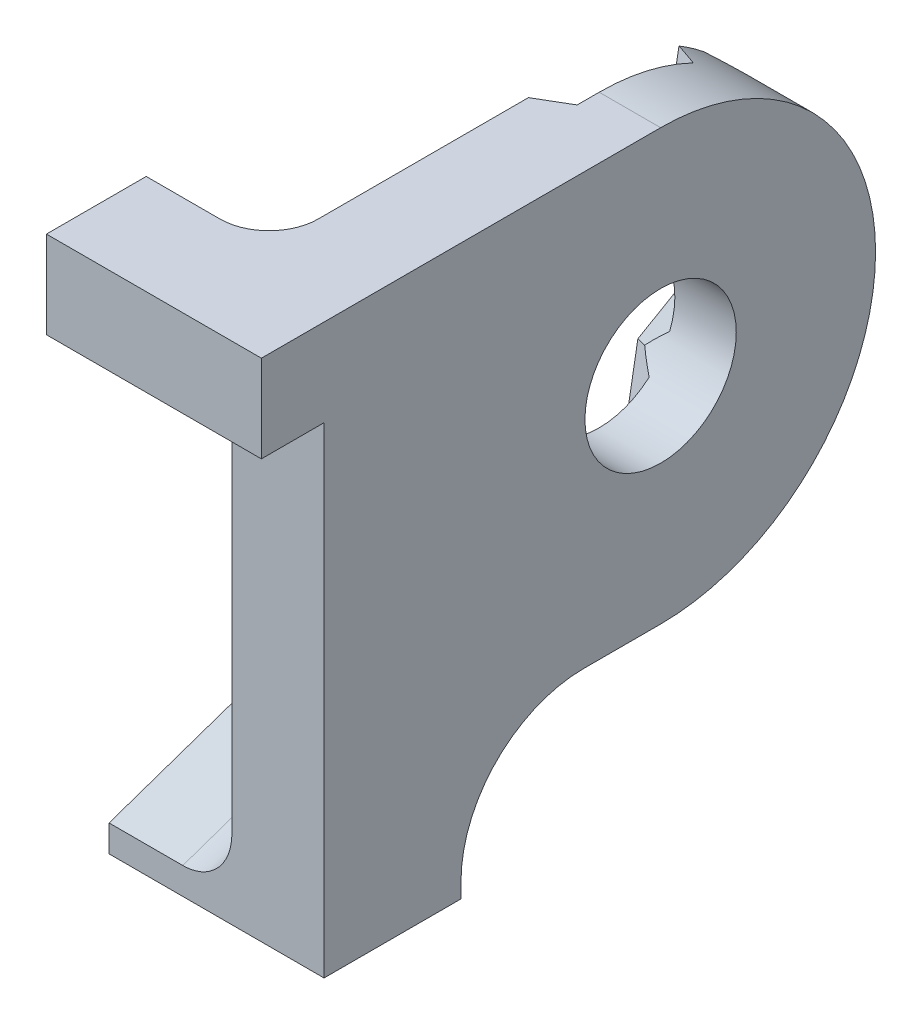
ISO-10303-21;
HEADER;
FILE_DESCRIPTION(('STEP AP214'),'2;1');
FILE_NAME('part.step','',(''),(''),'','','');
FILE_SCHEMA(('AUTOMOTIVE_DESIGN { 1 0 10303 214 1 1 1 1 }'));
ENDSEC;
DATA;
#1=APPLICATION_CONTEXT('core data for automotive mechanical design processes');
#2=APPLICATION_PROTOCOL_DEFINITION('international standard','automotive_design',2000,#1);
#3=PRODUCT_CONTEXT('',#1,'mechanical');
#4=PRODUCT('Part','Part','',(#3));
#5=PRODUCT_RELATED_PRODUCT_CATEGORY('part','',(#4));
#6=PRODUCT_DEFINITION_FORMATION('','',#4);
#7=PRODUCT_DEFINITION_CONTEXT('part definition',#1,'design');
#8=PRODUCT_DEFINITION('design','',#6,#7);
#9=PRODUCT_DEFINITION_SHAPE('','',#8);
#10=(LENGTH_UNIT() NAMED_UNIT(*) SI_UNIT(.MILLI.,.METRE.));
#11=(NAMED_UNIT(*) PLANE_ANGLE_UNIT() SI_UNIT($,.RADIAN.));
#12=(NAMED_UNIT(*) SI_UNIT($,.STERADIAN.) SOLID_ANGLE_UNIT());
#13=UNCERTAINTY_MEASURE_WITH_UNIT(LENGTH_MEASURE(1.E-05),#10,'distance_accuracy_value','');
#14=(GEOMETRIC_REPRESENTATION_CONTEXT(3) GLOBAL_UNCERTAINTY_ASSIGNED_CONTEXT((#13)) GLOBAL_UNIT_ASSIGNED_CONTEXT((#10,
#11,#12)) REPRESENTATION_CONTEXT('',''));
#15=CARTESIAN_POINT('',(0.,0.,0.));
#16=DIRECTION('',(0.,0.,1.));
#17=DIRECTION('',(1.,0.,0.));
#18=AXIS2_PLACEMENT_3D('',#15,#16,#17);
#19=CARTESIAN_POINT('',(1.5875,0.,0.));
#20=DIRECTION('',(-1.,0.,0.));
#21=DIRECTION('',(0.,0.,1.));
#22=AXIS2_PLACEMENT_3D('',#19,#20,#21);
#23=PLANE('',#22);
#24=CARTESIAN_POINT('',(1.5875,0.,0.));
#25=DIRECTION('',(-1.,0.,0.));
#26=DIRECTION('',(0.,0.,1.));
#27=AXIS2_PLACEMENT_3D('',#24,#25,#26);
#28=CIRCLE('',#27,11.1125);
#29=CARTESIAN_POINT('',(1.5875,11.1125,0.));
#30=VERTEX_POINT('',#29);
#31=CARTESIAN_POINT('',(1.5875,9.99277444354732,-4.86128739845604));
#32=VERTEX_POINT('',#31);
#33=EDGE_CURVE('E287',#30,#32,#28,.T.);
#34=ORIENTED_EDGE('',*,*,#33,.T.);
#35=DIRECTION('',(0.,-0.984807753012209,0.173648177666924));
#36=VECTOR('',#35,1.);
#37=CARTESIAN_POINT('',(1.5875,-0.530010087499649,-3.00583657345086));
#38=LINE('',#37,#36);
#39=CARTESIAN_POINT('',(1.5875,5.91602724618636,-4.14244687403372));
#40=VERTEX_POINT('',#39);
#41=EDGE_CURVE('E422',#32,#40,#38,.T.);
#42=ORIENTED_EDGE('',*,*,#41,.T.);
#43=DIRECTION('',(0.,0.499999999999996,-0.866025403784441));
#44=VECTOR('',#43,1.);
#45=CARTESIAN_POINT('',(1.5875,7.83310237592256,-7.46291840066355));
#46=LINE('',#45,#44);
#47=CARTESIAN_POINT('',(1.5875,7.98584604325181,-7.72747819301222));
#48=VERTEX_POINT('',#47);
#49=EDGE_CURVE('E420',#40,#48,#46,.T.);
#50=ORIENTED_EDGE('',*,*,#49,.T.);
#51=CARTESIAN_POINT('',(1.5875,2.69926940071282,-10.7796846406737));
#52=VERTEX_POINT('',#51);
#53=EDGE_CURVE('E286',#48,#52,#28,.T.);
#54=ORIENTED_EDGE('',*,*,#53,.T.);
#55=DIRECTION('',(0.,-0.499999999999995,0.866025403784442));
#56=VECTOR('',#55,1.);
#57=CARTESIAN_POINT('',(1.5875,-1.71795906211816,-3.12882051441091));
#58=LINE('',#57,#56);
#59=CARTESIAN_POINT('',(1.5875,-1.4201110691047,-3.64470837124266));
#60=VERTEX_POINT('',#59);
#61=EDGE_CURVE('E411',#52,#60,#58,.T.);
#62=ORIENTED_EDGE('',*,*,#61,.T.);
#63=CARTESIAN_POINT('',(1.5875,0.,0.));
#64=DIRECTION('',(-1.,0.,0.));
#65=DIRECTION('',(0.,0.,1.));
#66=AXIS2_PLACEMENT_3D('',#63,#64,#65);
#67=CIRCLE('',#66,3.9116);
#68=CARTESIAN_POINT('',(1.5875,2.93919896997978,2.58103157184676));
#69=VERTEX_POINT('',#68);
#70=EDGE_CURVE('E281',#69,#60,#67,.T.);
#71=ORIENTED_EDGE('',*,*,#70,.F.);
#72=DIRECTION('',(0.,0.984807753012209,-0.173648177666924));
#73=VECTOR('',#72,1.);
#74=CARTESIAN_POINT('',(1.5875,10.953343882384,1.16792159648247));
#75=LINE('',#74,#73);
#76=CARTESIAN_POINT('',(1.5875,11.1125,1.13985807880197));
#77=VERTEX_POINT('',#76);
#78=EDGE_CURVE('E418',#69,#77,#75,.T.);
#79=ORIENTED_EDGE('',*,*,#78,.T.);
#80=DIRECTION('',(0.,0.,-1.));
#81=VECTOR('',#80,1.);
#82=CARTESIAN_POINT('',(1.5875,11.1125,2.07054079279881));
#83=LINE('',#82,#81);
#84=EDGE_CURVE('E407',#77,#30,#83,.T.);
#85=ORIENTED_EDGE('',*,*,#84,.T.);
#86=EDGE_LOOP('',(#34,#42,#50,#54,#62,#71,#79,#85));
#87=FACE_BOUND('',#86,.T.);
#88=ADVANCED_FACE('F37',(#87),#23,.T.);
#89=CARTESIAN_POINT('',(0.,0.,0.));
#90=DIRECTION('',(-1.,0.,0.));
#91=DIRECTION('',(0.,0.,1.));
#92=AXIS2_PLACEMENT_3D('',#89,#90,#91);
#93=PLANE('',#92);
#94=DIRECTION('',(0.,-0.499999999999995,0.866025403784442));
#95=VECTOR('',#94,1.);
#96=CARTESIAN_POINT('',(0.,2.51170906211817,3.58709229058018));
#97=LINE('',#96,#95);
#98=CARTESIAN_POINT('',(0.,2.51170906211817,3.58709229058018));
#99=VERTEX_POINT('',#98);
#100=CARTESIAN_POINT('',(0.,-2.51608667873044,12.2954899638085));
#101=VERTEX_POINT('',#100);
#102=EDGE_CURVE('E240',#99,#101,#97,.T.);
#103=ORIENTED_EDGE('',*,*,#102,.T.);
#104=CARTESIAN_POINT('',(0.,-2.51608667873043,12.2954899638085));
#105=CARTESIAN_POINT('',(0.,-2.57222081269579,12.3927224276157));
#106=CARTESIAN_POINT('',(0.,-2.62954856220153,12.4892603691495));
#107=CARTESIAN_POINT('',(0.,-2.74654023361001,12.6809067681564));
#108=CARTESIAN_POINT('',(0.,-2.8062040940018,12.7760152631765));
#109=CARTESIAN_POINT('',(0.,-2.98857847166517,13.0590670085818));
#110=CARTESIAN_POINT('',(0.,-3.1147173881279,13.2448154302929));
#111=CARTESIAN_POINT('',(0.,-3.37467790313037,13.6091491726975));
#112=CARTESIAN_POINT('',(0.,-3.5084487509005,13.787770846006));
#113=CARTESIAN_POINT('',(0.,-3.78356531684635,14.13908811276));
#114=CARTESIAN_POINT('',(0.,-3.9249114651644,14.3117833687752));
#115=CARTESIAN_POINT('',(0.,-4.21403023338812,14.6511401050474));
#116=CARTESIAN_POINT('',(0.,-4.36179047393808,14.8178121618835));
#117=CARTESIAN_POINT('',(0.,-4.66313169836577,15.1458189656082));
#118=CARTESIAN_POINT('',(0.,-4.81671312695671,15.307153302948));
#119=CARTESIAN_POINT('',(0.,-5.12984263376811,15.6258826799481));
#120=CARTESIAN_POINT('',(0.,-5.28942184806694,15.7832470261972));
#121=CARTESIAN_POINT('',(0.,-5.61286757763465,16.0934035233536));
#122=CARTESIAN_POINT('',(0.,-5.7767326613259,16.2461971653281));
#123=CARTESIAN_POINT('',(0.,-5.942407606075,16.3969647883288));
#124=B_SPLINE_CURVE_WITH_KNOTS('',3,(#104,#105,#106,#107,#108,#109,#110,#111,#112,#113,#114,
#115,#116,#117,#118,#119,#120,#121,#122,#123),.UNSPECIFIED.,.F.,.F.,(4,2,2,2,2,2,2,2,2,4),(0.,
0.336800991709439,0.673593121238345,1.34690425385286,2.01616719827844,2.6854681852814,
3.35353032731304,4.02164360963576,4.6939068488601,5.36594833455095),.UNSPECIFIED.);
#125=CARTESIAN_POINT('',(0.,-5.942407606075,16.3969647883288));
#126=VERTEX_POINT('',#125);
#127=EDGE_CURVE('E435',#101,#126,#124,.T.);
#128=ORIENTED_EDGE('',*,*,#127,.T.);
#129=DIRECTION('',(0.,-0.866025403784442,-0.499999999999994));
#130=VECTOR('',#129,1.);
#131=CARTESIAN_POINT('',(0.,-0.386157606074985,19.6048672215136));
#132=LINE('',#131,#130);
#133=CARTESIAN_POINT('',(0.,-11.228984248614,13.3447583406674));
#134=VERTEX_POINT('',#133);
#135=EDGE_CURVE('E246',#126,#134,#132,.T.);
#136=ORIENTED_EDGE('',*,*,#135,.T.);
#137=CARTESIAN_POINT('',(0.,-11.228984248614,13.3447583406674));
#138=CARTESIAN_POINT('',(0.,-11.1812531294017,13.1258958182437));
#139=CARTESIAN_POINT('',(0.,-11.1308624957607,12.9075876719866));
#140=CARTESIAN_POINT('',(0.,-11.0239819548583,12.4723972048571));
#141=CARTESIAN_POINT('',(0.,-10.9674900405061,12.2555153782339));
#142=CARTESIAN_POINT('',(0.,-10.8480270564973,11.8249725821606));
#143=CARTESIAN_POINT('',(0.,-10.7850981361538,11.6112999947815));
#144=CARTESIAN_POINT('',(0.,-10.6517065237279,11.1863274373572));
#145=CARTESIAN_POINT('',(0.,-10.5812444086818,10.9750272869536));
#146=CARTESIAN_POINT('',(0.,-10.4319122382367,10.5549647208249));
#147=CARTESIAN_POINT('',(0.,-10.3530268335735,10.3462077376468));
#148=CARTESIAN_POINT('',(0.,-10.1863354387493,9.93229116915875));
#149=CARTESIAN_POINT('',(0.,-10.0985299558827,9.72713138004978));
#150=CARTESIAN_POINT('',(0.,-9.91298793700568,9.31983209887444));
#151=CARTESIAN_POINT('',(0.,-9.81519454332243,9.11771838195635));
#152=CARTESIAN_POINT('',(0.,-9.66125173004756,8.81825166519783));
#153=CARTESIAN_POINT('',(0.,-9.60871728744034,8.71902699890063));
#154=CARTESIAN_POINT('',(0.,-9.50124247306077,8.52188603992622));
#155=CARTESIAN_POINT('',(0.,-9.44630203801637,8.42396978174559));
#156=CARTESIAN_POINT('',(0.,-9.39016332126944,8.32673996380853));
#157=B_SPLINE_CURVE_WITH_KNOTS('',3,(#137,#138,#139,#140,#141,#142,#143,#144,#145,#146,#147,
#148,#149,#150,#151,#152,#153,#154,#155,#156),.UNSPECIFIED.,.F.,.F.,(4,2,2,2,2,2,2,2,2,4),(0.,
0.67204148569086,1.3443047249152,2.01241800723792,2.68048014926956,3.34978113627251,
4.0190440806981,4.69235521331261,5.02914734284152,5.36594833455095),.UNSPECIFIED.);
#158=CARTESIAN_POINT('',(0.,-9.39016332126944,8.32673996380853));
#159=VERTEX_POINT('',#158);
#160=EDGE_CURVE('E46',#134,#159,#157,.T.);
#161=ORIENTED_EDGE('',*,*,#160,.T.);
#162=DIRECTION('',(0.,0.499999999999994,-0.866025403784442));
#163=VECTOR('',#162,1.);
#164=CARTESIAN_POINT('',(0.,-9.39016332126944,8.32673996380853));
#165=LINE('',#164,#163);
#166=CARTESIAN_POINT('',(0.,-7.69254424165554,5.38637746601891));
#167=VERTEX_POINT('',#166);
#168=EDGE_CURVE('E260',#159,#167,#165,.T.);
#169=ORIENTED_EDGE('',*,*,#168,.T.);
#170=DIRECTION('',(0.,-0.984807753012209,0.173648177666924));
#171=VECTOR('',#170,1.);
#172=CARTESIAN_POINT('',(0.,-7.69254424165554,5.38637746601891));
#173=LINE('',#172,#171);
#174=CARTESIAN_POINT('',(0.,-11.4637228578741,6.05133800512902));
#175=VERTEX_POINT('',#174);
#176=EDGE_CURVE('E262',#167,#175,#173,.T.);
#177=ORIENTED_EDGE('',*,*,#176,.T.);
#178=CARTESIAN_POINT('',(0.,-17.4625,3.96875));
#179=DIRECTION('',(-1.,0.,0.));
#180=DIRECTION('',(0.,0.,1.));
#181=AXIS2_PLACEMENT_3D('',#178,#179,#180);
#182=CIRCLE('',#181,6.35);
#183=CARTESIAN_POINT('',(0.,-17.4625,10.31875));
#184=VERTEX_POINT('',#183);
#185=EDGE_CURVE('E336',#184,#175,#182,.T.);
#186=ORIENTED_EDGE('',*,*,#185,.F.);
#187=DIRECTION('',(0.,-1.,0.));
#188=VECTOR('',#187,1.);
#189=CARTESIAN_POINT('',(0.,0.,10.31875));
#190=LINE('',#189,#188);
#191=CARTESIAN_POINT('',(0.,-11.7464179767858,10.31875));
#192=VERTEX_POINT('',#191);
#193=EDGE_CURVE('E304',#192,#184,#190,.T.);
#194=ORIENTED_EDGE('',*,*,#193,.F.);
#195=DIRECTION('',(0.,0.325568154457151,-0.945518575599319));
#196=VECTOR('',#195,1.);
#197=CARTESIAN_POINT('',(0.,-14.4690829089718,18.2259431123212));
#198=LINE('',#197,#196);
#199=CARTESIAN_POINT('',(0.,-14.1843435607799,17.399));
#200=VERTEX_POINT('',#199);
#201=EDGE_CURVE('E389',#192,#200,#198,.F.);
#202=ORIENTED_EDGE('',*,*,#201,.T.);
#203=DIRECTION('',(0.,-1.,0.));
#204=VECTOR('',#203,1.);
#205=CARTESIAN_POINT('',(0.,6.604,17.399));
#206=LINE('',#205,#204);
#207=CARTESIAN_POINT('',(0.,6.604,17.399));
#208=VERTEX_POINT('',#207);
#209=EDGE_CURVE('E357',#208,#200,#206,.T.);
#210=ORIENTED_EDGE('',*,*,#209,.F.);
#211=DIRECTION('',(0.,0.,1.));
#212=VECTOR('',#211,1.);
#213=CARTESIAN_POINT('',(0.,6.604,0.));
#214=LINE('',#213,#212);
#215=CARTESIAN_POINT('',(0.,6.604,12.938125));
#216=VERTEX_POINT('',#215);
#217=EDGE_CURVE('E324',#216,#208,#214,.T.);
#218=ORIENTED_EDGE('',*,*,#217,.F.);
#219=DIRECTION('',(0.,-1.,0.));
#220=VECTOR('',#219,1.);
#221=CARTESIAN_POINT('',(0.,11.1125,12.938125));
#222=LINE('',#221,#220);
#223=CARTESIAN_POINT('',(0.,11.1125,12.938125));
#224=VERTEX_POINT('',#223);
#225=EDGE_CURVE('E387',#216,#224,#222,.F.);
#226=ORIENTED_EDGE('',*,*,#225,.T.);
#227=DIRECTION('',(0.,0.,1.));
#228=VECTOR('',#227,1.);
#229=CARTESIAN_POINT('',(0.,11.1125,0.));
#230=LINE('',#229,#228);
#231=CARTESIAN_POINT('',(0.,11.1125,2.07054079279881));
#232=VERTEX_POINT('',#231);
#233=EDGE_CURVE('E243',#232,#224,#230,.T.);
#234=ORIENTED_EDGE('',*,*,#233,.F.);
#235=DIRECTION('',(0.,-0.984807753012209,0.173648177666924));
#236=VECTOR('',#235,1.);
#237=CARTESIAN_POINT('',(0.,11.1125,2.07054079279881));
#238=LINE('',#237,#236);
#239=EDGE_CURVE('E236',#232,#99,#238,.T.);
#240=ORIENTED_EDGE('',*,*,#239,.T.);
#241=EDGE_LOOP('',(#103,#128,#136,#161,#169,#177,#186,#194,#202,#210,#218,#226,#234,#240));
#242=FACE_BOUND('',#241,.T.);
#243=ADVANCED_FACE('F238',(#242),#93,.T.);
#244=CARTESIAN_POINT('',(0.,0.,0.));
#245=DIRECTION('',(1.,0.,0.));
#246=DIRECTION('',(0.,0.,1.));
#247=AXIS2_PLACEMENT_3D('',#244,#245,#246);
#248=CIRCLE('',#247,11.1125);
#249=CARTESIAN_POINT('',(0.,8.62685237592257,-7.00464662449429));
#250=VERTEX_POINT('',#249);
#251=CARTESIAN_POINT('',(0.,9.53277203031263,-5.71085927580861));
#252=VERTEX_POINT('',#251);
#253=EDGE_CURVE('E331',#250,#252,#248,.T.);
#254=ORIENTED_EDGE('',*,*,#253,.F.);
#255=DIRECTION('',(0.,-0.499999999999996,0.866025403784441));
#256=VECTOR('',#255,1.);
#257=CARTESIAN_POINT('',(0.,8.99328832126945,-7.63933229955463));
#258=LINE('',#257,#256);
#259=CARTESIAN_POINT('',(0.,7.69254424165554,-5.3863774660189));
#260=VERTEX_POINT('',#259);
#261=EDGE_CURVE('E272',#250,#260,#258,.T.);
#262=ORIENTED_EDGE('',*,*,#261,.T.);
#263=DIRECTION('',(0.,-0.984807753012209,0.173648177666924));
#264=VECTOR('',#263,1.);
#265=CARTESIAN_POINT('',(0.,11.1125,-5.98940793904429));
#266=LINE('',#265,#264);
#267=EDGE_CURVE('E274',#252,#260,#266,.T.);
#268=ORIENTED_EDGE('',*,*,#267,.F.);
#269=EDGE_LOOP('',(#254,#262,#268));
#270=FACE_BOUND('',#269,.T.);
#271=ADVANCED_FACE('F455',(#270),#93,.T.);
#272=CARTESIAN_POINT('',(4.7625,0.,0.));
#273=DIRECTION('',(-1.,0.,0.));
#274=DIRECTION('',(0.,0.,1.));
#275=AXIS2_PLACEMENT_3D('',#272,#273,#274);
#276=CYLINDRICAL_SURFACE('',#275,11.1125);
#277=ORIENTED_EDGE('',*,*,#253,.T.);
#278=CARTESIAN_POINT('',(6.87407664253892,0.,0.));
#279=DIRECTION('',(0.500000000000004,-0.150383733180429,-0.852868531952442));
#280=DIRECTION('',(-0.866025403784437,-0.0868240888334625,-0.492403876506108));
#281=AXIS2_PLACEMENT_3D('',#278,#279,#280);
#282=ELLIPSE('',#281,22.2249999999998,11.1125);
#283=EDGE_CURVE('E431',#252,#32,#282,.T.);
#284=ORIENTED_EDGE('',*,*,#283,.T.);
#285=ORIENTED_EDGE('',*,*,#33,.F.);
#286=DIRECTION('',(-1.,0.,0.));
#287=VECTOR('',#286,1.);
#288=CARTESIAN_POINT('',(4.7625,11.1125,0.));
#289=LINE('',#288,#287);
#290=CARTESIAN_POINT('',(4.7625,11.1125,0.));
#291=VERTEX_POINT('',#290);
#292=EDGE_CURVE('E381',#291,#30,#289,.T.);
#293=ORIENTED_EDGE('',*,*,#292,.F.);
#294=CARTESIAN_POINT('',(4.7625,0.,0.));
#295=DIRECTION('',(1.,0.,0.));
#296=DIRECTION('',(0.,0.,1.));
#297=AXIS2_PLACEMENT_3D('',#294,#295,#296);
#298=CIRCLE('',#297,11.1125);
#299=CARTESIAN_POINT('',(4.7625,-11.1125,0.));
#300=VERTEX_POINT('',#299);
#301=EDGE_CURVE('E332',#300,#291,#298,.T.);
#302=ORIENTED_EDGE('',*,*,#301,.F.);
#303=DIRECTION('',(-1.,0.,0.));
#304=VECTOR('',#303,1.);
#305=CARTESIAN_POINT('',(4.7625,-11.1125,0.));
#306=LINE('',#305,#304);
#307=CARTESIAN_POINT('',(1.5875,-11.1125,0.));
#308=VERTEX_POINT('',#307);
#309=EDGE_CURVE('E352',#300,#308,#306,.T.);
#310=ORIENTED_EDGE('',*,*,#309,.T.);
#311=CARTESIAN_POINT('',(1.5875,-11.0527946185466,-1.15038574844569));
#312=VERTEX_POINT('',#311);
#313=EDGE_CURVE('E284',#312,#308,#28,.T.);
#314=ORIENTED_EDGE('',*,*,#313,.F.);
#315=CARTESIAN_POINT('',(6.87407664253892,0.,0.));
#316=DIRECTION('',(0.500000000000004,-0.150383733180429,-0.852868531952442));
#317=DIRECTION('',(-0.866025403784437,-0.0868240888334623,-0.492403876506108));
#318=AXIS2_PLACEMENT_3D('',#315,#316,#317);
#319=ELLIPSE('',#318,22.2249999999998,11.1125);
#320=CARTESIAN_POINT('',(0.,-10.9111044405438,-2.10605226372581));
#321=VERTEX_POINT('',#320);
#322=EDGE_CURVE('E627',#312,#321,#319,.T.);
#323=ORIENTED_EDGE('',*,*,#322,.T.);
#324=CARTESIAN_POINT('',(0.,1.75277573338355,-10.9733966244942));
#325=VERTEX_POINT('',#324);
#326=EDGE_CURVE('E355',#321,#325,#248,.T.);
#327=ORIENTED_EDGE('',*,*,#326,.T.);
#328=CARTESIAN_POINT('',(6.87407664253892,0.,0.));
#329=DIRECTION('',(-0.500000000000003,0.750000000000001,0.433012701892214));
#330=DIRECTION('',(-0.866025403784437,-0.433012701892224,-0.249999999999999));
#331=AXIS2_PLACEMENT_3D('',#328,#329,#330);
#332=ELLIPSE('',#331,22.2249999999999,11.1125);
#333=EDGE_CURVE('E623',#325,#52,#332,.F.);
#334=ORIENTED_EDGE('',*,*,#333,.T.);
#335=ORIENTED_EDGE('',*,*,#53,.F.);
#336=CARTESIAN_POINT('',(6.8740766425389,0.,0.));
#337=DIRECTION('',(-0.500000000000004,-0.75,-0.433012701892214));
#338=DIRECTION('',(-0.866025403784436,0.433012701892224,0.25));
#339=AXIS2_PLACEMENT_3D('',#336,#337,#338);
#340=ELLIPSE('',#339,22.2249999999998,11.1125);
#341=EDGE_CURVE('E433',#48,#250,#340,.F.);
#342=ORIENTED_EDGE('',*,*,#341,.T.);
#343=EDGE_LOOP('',(#277,#284,#285,#293,#302,#310,#314,#323,#327,#334,#335,#342));
#344=FACE_BOUND('',#343,.T.);
#345=ADVANCED_FACE('F597',(#344),#276,.T.);
#346=CARTESIAN_POINT('',(4.7625,11.1125,0.));
#347=DIRECTION('',(0.,-1.,0.));
#348=DIRECTION('',(0.,0.,-1.));
#349=AXIS2_PLACEMENT_3D('',#346,#347,#348);
#350=PLANE('',#349);
#351=ORIENTED_EDGE('',*,*,#84,.F.);
#352=DIRECTION('',(0.862679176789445,0.,-0.505751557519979));
#353=VECTOR('',#352,1.);
#354=CARTESIAN_POINT('',(4.44770537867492,11.1125,-0.536956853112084));
#355=LINE('',#354,#353);
#356=EDGE_CURVE('E631',#77,#232,#355,.F.);
#357=ORIENTED_EDGE('',*,*,#356,.T.);
#358=ORIENTED_EDGE('',*,*,#233,.T.);
#359=CARTESIAN_POINT('',(-2.54,11.1125,12.938125));
#360=DIRECTION('',(0.,-1.,0.));
#361=DIRECTION('',(0.,0.,-1.));
#362=AXIS2_PLACEMENT_3D('',#359,#360,#361);
#363=CIRCLE('',#362,2.54);
#364=CARTESIAN_POINT('',(-2.54,11.1125,15.478125));
#365=VERTEX_POINT('',#364);
#366=EDGE_CURVE('E402',#224,#365,#363,.T.);
#367=ORIENTED_EDGE('',*,*,#366,.T.);
#368=DIRECTION('',(1.,0.,0.));
#369=VECTOR('',#368,1.);
#370=CARTESIAN_POINT('',(-6.35,11.1125,15.478125));
#371=LINE('',#370,#369);
#372=CARTESIAN_POINT('',(-6.35,11.1125,15.478125));
#373=VERTEX_POINT('',#372);
#374=EDGE_CURVE('E321',#373,#365,#371,.T.);
#375=ORIENTED_EDGE('',*,*,#374,.F.);
#376=DIRECTION('',(0.,0.,1.));
#377=VECTOR('',#376,1.);
#378=CARTESIAN_POINT('',(-6.35,11.1125,20.6375));
#379=LINE('',#378,#377);
#380=CARTESIAN_POINT('',(-6.35,11.1125,20.6375));
#381=VERTEX_POINT('',#380);
#382=EDGE_CURVE('E317',#373,#381,#379,.T.);
#383=ORIENTED_EDGE('',*,*,#382,.T.);
#384=DIRECTION('',(-1.,0.,0.));
#385=VECTOR('',#384,1.);
#386=CARTESIAN_POINT('',(4.7625,11.1125,20.6375));
#387=LINE('',#386,#385);
#388=CARTESIAN_POINT('',(4.7625,11.1125,20.6375));
#389=VERTEX_POINT('',#388);
#390=EDGE_CURVE('E379',#389,#381,#387,.T.);
#391=ORIENTED_EDGE('',*,*,#390,.F.);
#392=DIRECTION('',(0.,0.,1.));
#393=VECTOR('',#392,1.);
#394=CARTESIAN_POINT('',(4.7625,11.1125,0.));
#395=LINE('',#394,#393);
#396=EDGE_CURVE('E335',#291,#389,#395,.T.);
#397=ORIENTED_EDGE('',*,*,#396,.F.);
#398=ORIENTED_EDGE('',*,*,#292,.T.);
#399=EDGE_LOOP('',(#351,#357,#358,#367,#375,#383,#391,#397,#398));
#400=FACE_BOUND('',#399,.T.);
#401=ADVANCED_FACE('F576',(#400),#350,.F.);
#402=CARTESIAN_POINT('',(4.7625,-11.1125,0.));
#403=DIRECTION('',(0.,1.,0.));
#404=DIRECTION('',(0.,0.,1.));
#405=AXIS2_PLACEMENT_3D('',#402,#403,#404);
#406=PLANE('',#405);
#407=DIRECTION('',(0.,0.,1.));
#408=VECTOR('',#407,1.);
#409=CARTESIAN_POINT('',(1.5875,-11.1125,0.));
#410=LINE('',#409,#408);
#411=CARTESIAN_POINT('',(1.5875,-11.1125,3.96874999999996));
#412=VERTEX_POINT('',#411);
#413=EDGE_CURVE('E278',#308,#412,#410,.T.);
#414=ORIENTED_EDGE('',*,*,#413,.F.);
#415=ORIENTED_EDGE('',*,*,#309,.F.);
#416=DIRECTION('',(0.,0.,-1.));
#417=VECTOR('',#416,1.);
#418=CARTESIAN_POINT('',(4.7625,-11.1125,0.));
#419=LINE('',#418,#417);
#420=CARTESIAN_POINT('',(4.7625,-11.1125,3.96874999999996));
#421=VERTEX_POINT('',#420);
#422=EDGE_CURVE('E350',#421,#300,#419,.T.);
#423=ORIENTED_EDGE('',*,*,#422,.F.);
#424=DIRECTION('',(-1.,0.,0.));
#425=VECTOR('',#424,1.);
#426=CARTESIAN_POINT('',(4.7625,-11.1125,3.96874999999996));
#427=LINE('',#426,#425);
#428=EDGE_CURVE('E364',#421,#412,#427,.T.);
#429=ORIENTED_EDGE('',*,*,#428,.T.);
#430=EDGE_LOOP('',(#414,#415,#423,#429));
#431=FACE_BOUND('',#430,.T.);
#432=ADVANCED_FACE('F457',(#431),#406,.F.);
#433=CARTESIAN_POINT('',(4.7625,0.,0.));
#434=DIRECTION('',(-1.,0.,0.));
#435=DIRECTION('',(0.,0.,1.));
#436=AXIS2_PLACEMENT_3D('',#433,#434,#435);
#437=CYLINDRICAL_SURFACE('',#436,3.9116);
#438=CARTESIAN_POINT('',(4.7625,0.,0.));
#439=DIRECTION('',(1.,0.,0.));
#440=DIRECTION('',(0.,0.,-1.));
#441=AXIS2_PLACEMENT_3D('',#438,#439,#440);
#442=CIRCLE('',#441,3.9116);
#443=CARTESIAN_POINT('',(4.7625,0.,-3.9116));
#444=VERTEX_POINT('',#443);
#445=EDGE_CURVE('E328',#444,#444,#442,.T.);
#446=ORIENTED_EDGE('',*,*,#445,.T.);
#447=EDGE_LOOP('',(#446));
#448=FACE_BOUND('',#447,.T.);
#449=CARTESIAN_POINT('',(1.5875,-2.93919896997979,-2.58103157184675));
#450=VERTEX_POINT('',#449);
#451=CARTESIAN_POINT('',(1.5875,1.42011106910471,3.64470837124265));
#452=VERTEX_POINT('',#451);
#453=EDGE_CURVE('E405',#450,#452,#67,.T.);
#454=ORIENTED_EDGE('',*,*,#453,.T.);
#455=CARTESIAN_POINT('',(6.87407664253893,0.,0.));
#456=DIRECTION('',(-0.500000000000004,-0.750000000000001,-0.433012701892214));
#457=DIRECTION('',(-0.866025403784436,0.433012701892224,0.249999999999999));
#458=AXIS2_PLACEMENT_3D('',#455,#456,#457);
#459=ELLIPSE('',#458,7.82319999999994,3.9116);
#460=CARTESIAN_POINT('',(0.733759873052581,2.24360158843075,3.20419513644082));
#461=VERTEX_POINT('',#460);
#462=EDGE_CURVE('E61',#452,#461,#459,.T.);
#463=ORIENTED_EDGE('',*,*,#462,.T.);
#464=CARTESIAN_POINT('',(6.87407664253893,0.,0.));
#465=DIRECTION('',(-0.500000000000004,-0.150383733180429,-0.852868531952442));
#466=DIRECTION('',(-0.866025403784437,0.0868240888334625,0.492403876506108));
#467=AXIS2_PLACEMENT_3D('',#464,#465,#466);
#468=ELLIPSE('',#467,7.82319999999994,3.9116);
#469=EDGE_CURVE('E252',#461,#69,#468,.T.);
#470=ORIENTED_EDGE('',*,*,#469,.T.);
#471=ORIENTED_EDGE('',*,*,#70,.T.);
#472=CARTESIAN_POINT('',(6.87407664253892,0.,0.));
#473=DIRECTION('',(-0.500000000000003,0.750000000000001,0.433012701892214));
#474=DIRECTION('',(-0.866025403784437,-0.433012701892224,-0.249999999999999));
#475=AXIS2_PLACEMENT_3D('',#472,#473,#474);
#476=ELLIPSE('',#475,7.82319999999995,3.9116);
#477=CARTESIAN_POINT('',(0.733759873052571,-2.24360158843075,-3.20419513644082));
#478=VERTEX_POINT('',#477);
#479=EDGE_CURVE('E54',#60,#478,#476,.T.);
#480=ORIENTED_EDGE('',*,*,#479,.T.);
#481=CARTESIAN_POINT('',(6.87407664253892,0.,0.));
#482=DIRECTION('',(0.500000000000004,-0.150383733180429,-0.852868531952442));
#483=DIRECTION('',(-0.866025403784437,-0.0868240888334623,-0.492403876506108));
#484=AXIS2_PLACEMENT_3D('',#481,#482,#483);
#485=ELLIPSE('',#484,7.82319999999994,3.9116);
#486=EDGE_CURVE('E625',#478,#450,#485,.F.);
#487=ORIENTED_EDGE('',*,*,#486,.T.);
#488=EDGE_LOOP('',(#454,#463,#470,#471,#480,#487));
#489=FACE_BOUND('',#488,.T.);
#490=ADVANCED_FACE('F632',(#448,#489),#437,.F.);
#491=CARTESIAN_POINT('',(4.7625,0.,0.));
#492=DIRECTION('',(-1.,0.,0.));
#493=DIRECTION('',(0.,0.,1.));
#494=AXIS2_PLACEMENT_3D('',#491,#492,#493);
#495=PLANE('',#494);
#496=DIRECTION('',(0.,-1.,0.));
#497=VECTOR('',#496,1.);
#498=CARTESIAN_POINT('',(4.7625,6.604,17.399));
#499=LINE('',#498,#497);
#500=CARTESIAN_POINT('',(4.7625,6.604,17.399));
#501=VERTEX_POINT('',#500);
#502=CARTESIAN_POINT('',(4.7625,-18.25625,17.399));
#503=VERTEX_POINT('',#502);
#504=EDGE_CURVE('E342',#501,#503,#499,.T.);
#505=ORIENTED_EDGE('',*,*,#504,.T.);
#506=DIRECTION('',(0.,0.,-1.));
#507=VECTOR('',#506,1.);
#508=CARTESIAN_POINT('',(4.7625,-18.25625,17.399));
#509=LINE('',#508,#507);
#510=CARTESIAN_POINT('',(4.7625,-18.25625,10.31875));
#511=VERTEX_POINT('',#510);
#512=EDGE_CURVE('E344',#503,#511,#509,.T.);
#513=ORIENTED_EDGE('',*,*,#512,.T.);
#514=DIRECTION('',(0.,1.,0.));
#515=VECTOR('',#514,1.);
#516=CARTESIAN_POINT('',(4.7625,-18.25625,10.31875));
#517=LINE('',#516,#515);
#518=CARTESIAN_POINT('',(4.7625,-17.4625,10.31875));
#519=VERTEX_POINT('',#518);
#520=EDGE_CURVE('E346',#511,#519,#517,.T.);
#521=ORIENTED_EDGE('',*,*,#520,.T.);
#522=CARTESIAN_POINT('',(4.7625,-17.4625,3.96875));
#523=DIRECTION('',(-1.,0.,0.));
#524=DIRECTION('',(0.,0.,1.));
#525=AXIS2_PLACEMENT_3D('',#522,#523,#524);
#526=CIRCLE('',#525,6.35);
#527=EDGE_CURVE('E348',#519,#421,#526,.T.);
#528=ORIENTED_EDGE('',*,*,#527,.T.);
#529=ORIENTED_EDGE('',*,*,#422,.T.);
#530=ORIENTED_EDGE('',*,*,#301,.T.);
#531=ORIENTED_EDGE('',*,*,#396,.T.);
#532=DIRECTION('',(0.,-1.,0.));
#533=VECTOR('',#532,1.);
#534=CARTESIAN_POINT('',(4.7625,11.1125,20.6375));
#535=LINE('',#534,#533);
#536=CARTESIAN_POINT('',(4.7625,6.604,20.6375));
#537=VERTEX_POINT('',#536);
#538=EDGE_CURVE('E338',#389,#537,#535,.T.);
#539=ORIENTED_EDGE('',*,*,#538,.T.);
#540=DIRECTION('',(0.,0.,-1.));
#541=VECTOR('',#540,1.);
#542=CARTESIAN_POINT('',(4.7625,6.604,20.6375));
#543=LINE('',#542,#541);
#544=EDGE_CURVE('E340',#537,#501,#543,.T.);
#545=ORIENTED_EDGE('',*,*,#544,.T.);
#546=EDGE_LOOP('',(#505,#513,#521,#528,#529,#530,#531,#539,#545));
#547=FACE_BOUND('',#546,.T.);
#548=ORIENTED_EDGE('',*,*,#445,.F.);
#549=EDGE_LOOP('',(#548));
#550=FACE_BOUND('',#549,.T.);
#551=ADVANCED_FACE('F453',(#547,#550),#495,.F.);
#552=DIRECTION('',(0.,-0.984807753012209,0.173648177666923));
#553=VECTOR('',#552,1.);
#554=CARTESIAN_POINT('',(0.,-2.51170906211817,-3.58709229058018));
#555=LINE('',#554,#553);
#556=CARTESIAN_POINT('',(0.,-2.51170906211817,-3.58709229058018));
#557=VERTEX_POINT('',#556);
#558=EDGE_CURVE('E267',#557,#321,#555,.T.);
#559=ORIENTED_EDGE('',*,*,#558,.F.);
#560=DIRECTION('',(0.,0.499999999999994,-0.866025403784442));
#561=VECTOR('',#560,1.);
#562=CARTESIAN_POINT('',(0.,-2.51170906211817,-3.58709229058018));
#563=LINE('',#562,#561);
#564=EDGE_CURVE('E270',#557,#325,#563,.T.);
#565=ORIENTED_EDGE('',*,*,#564,.T.);
#566=ORIENTED_EDGE('',*,*,#326,.F.);
#567=EDGE_LOOP('',(#559,#565,#566));
#568=FACE_BOUND('',#567,.T.);
#569=ADVANCED_FACE('F447',(#568),#93,.T.);
#570=CARTESIAN_POINT('',(4.7625,11.1125,20.6375));
#571=DIRECTION('',(0.,0.,-1.));
#572=DIRECTION('',(-1.,0.,0.));
#573=AXIS2_PLACEMENT_3D('',#570,#571,#572);
#574=PLANE('',#573);
#575=ORIENTED_EDGE('',*,*,#390,.T.);
#576=DIRECTION('',(0.,-1.,0.));
#577=VECTOR('',#576,1.);
#578=CARTESIAN_POINT('',(-6.35,11.1125,20.6375));
#579=LINE('',#578,#577);
#580=CARTESIAN_POINT('',(-6.35,6.604,20.6375));
#581=VERTEX_POINT('',#580);
#582=EDGE_CURVE('E308',#381,#581,#579,.T.);
#583=ORIENTED_EDGE('',*,*,#582,.T.);
#584=DIRECTION('',(-1.,0.,0.));
#585=VECTOR('',#584,1.);
#586=CARTESIAN_POINT('',(4.7625,6.604,20.6375));
#587=LINE('',#586,#585);
#588=EDGE_CURVE('E377',#537,#581,#587,.T.);
#589=ORIENTED_EDGE('',*,*,#588,.F.);
#590=ORIENTED_EDGE('',*,*,#538,.F.);
#591=EDGE_LOOP('',(#575,#583,#589,#590));
#592=FACE_BOUND('',#591,.T.);
#593=ADVANCED_FACE('F452',(#592),#574,.F.);
#594=CARTESIAN_POINT('',(4.7625,6.604,20.6375));
#595=DIRECTION('',(0.,1.,0.));
#596=DIRECTION('',(0.,0.,1.));
#597=AXIS2_PLACEMENT_3D('',#594,#595,#596);
#598=PLANE('',#597);
#599=ORIENTED_EDGE('',*,*,#588,.T.);
#600=DIRECTION('',(0.,0.,-1.));
#601=VECTOR('',#600,1.);
#602=CARTESIAN_POINT('',(-6.35,6.604,20.6375));
#603=LINE('',#602,#601);
#604=CARTESIAN_POINT('',(-6.35,6.604,15.478125));
#605=VERTEX_POINT('',#604);
#606=EDGE_CURVE('E311',#581,#605,#603,.T.);
#607=ORIENTED_EDGE('',*,*,#606,.T.);
#608=DIRECTION('',(1.,0.,0.));
#609=VECTOR('',#608,1.);
#610=CARTESIAN_POINT('',(-6.35,6.604,15.478125));
#611=LINE('',#610,#609);
#612=CARTESIAN_POINT('',(-2.54,6.604,15.478125));
#613=VERTEX_POINT('',#612);
#614=EDGE_CURVE('E320',#605,#613,#611,.T.);
#615=ORIENTED_EDGE('',*,*,#614,.T.);
#616=CARTESIAN_POINT('',(-2.54,6.604,12.938125));
#617=DIRECTION('',(0.,1.,0.));
#618=DIRECTION('',(0.,0.,1.));
#619=AXIS2_PLACEMENT_3D('',#616,#617,#618);
#620=CIRCLE('',#619,2.54);
#621=EDGE_CURVE('E399',#613,#216,#620,.T.);
#622=ORIENTED_EDGE('',*,*,#621,.T.);
#623=ORIENTED_EDGE('',*,*,#217,.T.);
#624=DIRECTION('',(-1.,0.,0.));
#625=VECTOR('',#624,1.);
#626=CARTESIAN_POINT('',(4.7625,6.604,17.399));
#627=LINE('',#626,#625);
#628=EDGE_CURVE('E374',#501,#208,#627,.T.);
#629=ORIENTED_EDGE('',*,*,#628,.F.);
#630=ORIENTED_EDGE('',*,*,#544,.F.);
#631=EDGE_LOOP('',(#599,#607,#615,#622,#623,#629,#630));
#632=FACE_BOUND('',#631,.T.);
#633=ADVANCED_FACE('F570',(#632),#598,.F.);
#634=CARTESIAN_POINT('',(4.7625,6.604,17.399));
#635=DIRECTION('',(0.,0.,-1.));
#636=DIRECTION('',(0.,1.,0.));
#637=AXIS2_PLACEMENT_3D('',#634,#635,#636);
#638=PLANE('',#637);
#639=ORIENTED_EDGE('',*,*,#209,.T.);
#640=CARTESIAN_POINT('',(-2.54,-14.1843435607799,17.399));
#641=DIRECTION('',(0.,0.,-1.));
#642=DIRECTION('',(0.,-1.,0.));
#643=AXIS2_PLACEMENT_3D('',#640,#641,#642);
#644=ELLIPSE('',#643,2.68635653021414,2.54);
#645=CARTESIAN_POINT('',(-2.54,-16.870700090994,17.399));
#646=VERTEX_POINT('',#645);
#647=EDGE_CURVE('E397',#200,#646,#644,.T.);
#648=ORIENTED_EDGE('',*,*,#647,.T.);
#649=DIRECTION('',(1.,0.,0.));
#650=VECTOR('',#649,1.);
#651=CARTESIAN_POINT('',(-6.35,-16.870700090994,17.399));
#652=LINE('',#651,#650);
#653=CARTESIAN_POINT('',(-6.35,-16.870700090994,17.399));
#654=VERTEX_POINT('',#653);
#655=EDGE_CURVE('E301',#654,#646,#652,.T.);
#656=ORIENTED_EDGE('',*,*,#655,.F.);
#657=DIRECTION('',(0.,-1.,0.));
#658=VECTOR('',#657,1.);
#659=CARTESIAN_POINT('',(-6.35,-16.870700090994,17.399));
#660=LINE('',#659,#658);
#661=CARTESIAN_POINT('',(-6.35,-18.25625,17.399));
#662=VERTEX_POINT('',#661);
#663=EDGE_CURVE('E288',#654,#662,#660,.T.);
#664=ORIENTED_EDGE('',*,*,#663,.T.);
#665=DIRECTION('',(-1.,0.,0.));
#666=VECTOR('',#665,1.);
#667=CARTESIAN_POINT('',(4.7625,-18.25625,17.399));
#668=LINE('',#667,#666);
#669=EDGE_CURVE('E372',#503,#662,#668,.T.);
#670=ORIENTED_EDGE('',*,*,#669,.F.);
#671=ORIENTED_EDGE('',*,*,#504,.F.);
#672=ORIENTED_EDGE('',*,*,#628,.T.);
#673=EDGE_LOOP('',(#639,#648,#656,#664,#670,#671,#672));
#674=FACE_BOUND('',#673,.T.);
#675=ADVANCED_FACE('F547',(#674),#638,.F.);
#676=CARTESIAN_POINT('',(4.7625,-18.25625,17.399));
#677=DIRECTION('',(0.,1.,0.));
#678=DIRECTION('',(0.,0.,1.));
#679=AXIS2_PLACEMENT_3D('',#676,#677,#678);
#680=PLANE('',#679);
#681=ORIENTED_EDGE('',*,*,#669,.T.);
#682=DIRECTION('',(0.,0.,-1.));
#683=VECTOR('',#682,1.);
#684=CARTESIAN_POINT('',(-6.35,-18.25625,17.399));
#685=LINE('',#684,#683);
#686=CARTESIAN_POINT('',(-6.35,-18.25625,10.31875));
#687=VERTEX_POINT('',#686);
#688=EDGE_CURVE('E291',#662,#687,#685,.T.);
#689=ORIENTED_EDGE('',*,*,#688,.T.);
#690=DIRECTION('',(-1.,0.,0.));
#691=VECTOR('',#690,1.);
#692=CARTESIAN_POINT('',(4.7625,-18.25625,10.31875));
#693=LINE('',#692,#691);
#694=EDGE_CURVE('E370',#511,#687,#693,.T.);
#695=ORIENTED_EDGE('',*,*,#694,.F.);
#696=ORIENTED_EDGE('',*,*,#512,.F.);
#697=EDGE_LOOP('',(#681,#689,#695,#696));
#698=FACE_BOUND('',#697,.T.);
#699=ADVANCED_FACE('F563',(#698),#680,.F.);
#700=CARTESIAN_POINT('',(4.7625,-18.25625,10.31875));
#701=DIRECTION('',(0.,0.,1.));
#702=DIRECTION('',(1.,0.,0.));
#703=AXIS2_PLACEMENT_3D('',#700,#701,#702);
#704=PLANE('',#703);
#705=ORIENTED_EDGE('',*,*,#694,.T.);
#706=DIRECTION('',(0.,1.,0.));
#707=VECTOR('',#706,1.);
#708=CARTESIAN_POINT('',(-6.35,-18.25625,10.31875));
#709=LINE('',#708,#707);
#710=CARTESIAN_POINT('',(-6.35,-14.4327745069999,10.31875));
#711=VERTEX_POINT('',#710);
#712=EDGE_CURVE('E294',#687,#711,#709,.T.);
#713=ORIENTED_EDGE('',*,*,#712,.T.);
#714=DIRECTION('',(1.,0.,0.));
#715=VECTOR('',#714,1.);
#716=CARTESIAN_POINT('',(-6.35,-14.4327745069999,10.31875));
#717=LINE('',#716,#715);
#718=CARTESIAN_POINT('',(-2.54,-14.4327745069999,10.31875));
#719=VERTEX_POINT('',#718);
#720=EDGE_CURVE('E300',#711,#719,#717,.T.);
#721=ORIENTED_EDGE('',*,*,#720,.T.);
#722=CARTESIAN_POINT('',(-2.54,-11.7464179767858,10.31875));
#723=DIRECTION('',(0.,0.,1.));
#724=DIRECTION('',(0.,-1.,0.));
#725=AXIS2_PLACEMENT_3D('',#722,#723,#724);
#726=ELLIPSE('',#725,2.68635653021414,2.54);
#727=EDGE_CURVE('E394',#719,#192,#726,.T.);
#728=ORIENTED_EDGE('',*,*,#727,.T.);
#729=ORIENTED_EDGE('',*,*,#193,.T.);
#730=DIRECTION('',(-1.,0.,0.));
#731=VECTOR('',#730,1.);
#732=CARTESIAN_POINT('',(4.7625,-17.4625,10.31875));
#733=LINE('',#732,#731);
#734=EDGE_CURVE('E367',#519,#184,#733,.T.);
#735=ORIENTED_EDGE('',*,*,#734,.F.);
#736=ORIENTED_EDGE('',*,*,#520,.F.);
#737=EDGE_LOOP('',(#705,#713,#721,#728,#729,#735,#736));
#738=FACE_BOUND('',#737,.T.);
#739=ADVANCED_FACE('F541',(#738),#704,.F.);
#740=CARTESIAN_POINT('',(4.7625,-17.4625,3.96875));
#741=DIRECTION('',(-1.,0.,0.));
#742=DIRECTION('',(0.,0.,1.));
#743=AXIS2_PLACEMENT_3D('',#740,#741,#742);
#744=CYLINDRICAL_SURFACE('',#743,6.35);
#745=ORIENTED_EDGE('',*,*,#185,.T.);
#746=CARTESIAN_POINT('',(5.35658455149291,-17.4625,3.96875));
#747=DIRECTION('',(-0.500000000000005,-0.150383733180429,-0.852868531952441));
#748=DIRECTION('',(-0.866025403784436,0.086824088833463,0.49240387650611));
#749=AXIS2_PLACEMENT_3D('',#746,#747,#748);
#750=ELLIPSE('',#749,12.6999999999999,6.35);
#751=CARTESIAN_POINT('',(1.5875,-11.2097585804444,5.07587453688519));
#752=VERTEX_POINT('',#751);
#753=EDGE_CURVE('E11',#175,#752,#750,.T.);
#754=ORIENTED_EDGE('',*,*,#753,.T.);
#755=CARTESIAN_POINT('',(1.5875,-17.4625,3.96875));
#756=DIRECTION('',(-1.,0.,0.));
#757=DIRECTION('',(0.,0.,1.));
#758=AXIS2_PLACEMENT_3D('',#755,#756,#757);
#759=CIRCLE('',#758,6.35);
#760=EDGE_CURVE('E280',#412,#752,#759,.F.);
#761=ORIENTED_EDGE('',*,*,#760,.F.);
#762=ORIENTED_EDGE('',*,*,#428,.F.);
#763=ORIENTED_EDGE('',*,*,#527,.F.);
#764=ORIENTED_EDGE('',*,*,#734,.T.);
#765=EDGE_LOOP('',(#745,#754,#761,#762,#763,#764));
#766=FACE_BOUND('',#765,.T.);
#767=ADVANCED_FACE('F534',(#766),#744,.F.);
#768=CARTESIAN_POINT('',(-6.35,11.1125,15.478125));
#769=DIRECTION('',(0.,0.,-1.));
#770=DIRECTION('',(0.,1.,0.));
#771=AXIS2_PLACEMENT_3D('',#768,#769,#770);
#772=PLANE('',#771);
#773=ORIENTED_EDGE('',*,*,#374,.T.);
#774=DIRECTION('',(0.,-1.,0.));
#775=VECTOR('',#774,1.);
#776=CARTESIAN_POINT('',(-2.54,6.604,15.478125));
#777=LINE('',#776,#775);
#778=EDGE_CURVE('E391',#365,#613,#777,.T.);
#779=ORIENTED_EDGE('',*,*,#778,.T.);
#780=ORIENTED_EDGE('',*,*,#614,.F.);
#781=DIRECTION('',(0.,1.,0.));
#782=VECTOR('',#781,1.);
#783=CARTESIAN_POINT('',(-6.35,11.1125,15.478125));
#784=LINE('',#783,#782);
#785=EDGE_CURVE('E314',#605,#373,#784,.T.);
#786=ORIENTED_EDGE('',*,*,#785,.T.);
#787=EDGE_LOOP('',(#773,#779,#780,#786));
#788=FACE_BOUND('',#787,.T.);
#789=ADVANCED_FACE('F578',(#788),#772,.T.);
#790=CARTESIAN_POINT('',(-6.35,0.,0.));
#791=DIRECTION('',(1.,0.,0.));
#792=DIRECTION('',(0.,0.,-1.));
#793=AXIS2_PLACEMENT_3D('',#790,#791,#792);
#794=PLANE('',#793);
#795=ORIENTED_EDGE('',*,*,#582,.F.);
#796=ORIENTED_EDGE('',*,*,#382,.F.);
#797=ORIENTED_EDGE('',*,*,#785,.F.);
#798=ORIENTED_EDGE('',*,*,#606,.F.);
#799=EDGE_LOOP('',(#795,#796,#797,#798));
#800=FACE_BOUND('',#799,.T.);
#801=ADVANCED_FACE('F584',(#800),#794,.F.);
#802=CARTESIAN_POINT('',(-6.35,-14.4327745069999,10.31875));
#803=DIRECTION('',(0.,0.945518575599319,0.325568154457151));
#804=DIRECTION('',(0.,-0.325568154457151,0.945518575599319));
#805=AXIS2_PLACEMENT_3D('',#802,#803,#804);
#806=PLANE('',#805);
#807=ORIENTED_EDGE('',*,*,#655,.T.);
#808=DIRECTION('',(0.,0.325568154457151,-0.945518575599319));
#809=VECTOR('',#808,1.);
#810=CARTESIAN_POINT('',(-2.54,-14.4327745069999,10.31875));
#811=LINE('',#810,#809);
#812=EDGE_CURVE('E384',#646,#719,#811,.T.);
#813=ORIENTED_EDGE('',*,*,#812,.T.);
#814=ORIENTED_EDGE('',*,*,#720,.F.);
#815=DIRECTION('',(0.,-0.325568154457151,0.945518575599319));
#816=VECTOR('',#815,1.);
#817=CARTESIAN_POINT('',(-6.35,-14.4327745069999,10.31875));
#818=LINE('',#817,#816);
#819=EDGE_CURVE('E297',#711,#654,#818,.T.);
#820=ORIENTED_EDGE('',*,*,#819,.T.);
#821=EDGE_LOOP('',(#807,#813,#814,#820));
#822=FACE_BOUND('',#821,.T.);
#823=ADVANCED_FACE('F552',(#822),#806,.T.);
#824=CARTESIAN_POINT('',(-6.35,0.,0.));
#825=DIRECTION('',(1.,0.,0.));
#826=DIRECTION('',(0.,0.,-1.));
#827=AXIS2_PLACEMENT_3D('',#824,#825,#826);
#828=PLANE('',#827);
#829=ORIENTED_EDGE('',*,*,#663,.F.);
#830=ORIENTED_EDGE('',*,*,#819,.F.);
#831=ORIENTED_EDGE('',*,*,#712,.F.);
#832=ORIENTED_EDGE('',*,*,#688,.F.);
#833=EDGE_LOOP('',(#829,#830,#831,#832));
#834=FACE_BOUND('',#833,.T.);
#835=ADVANCED_FACE('F559',(#834),#828,.F.);
#836=CARTESIAN_POINT('',(-2.54,-12.0311573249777,11.1456931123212));
#837=DIRECTION('',(0.,-0.325568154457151,0.945518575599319));
#838=DIRECTION('',(0.,-0.945518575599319,-0.325568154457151));
#839=AXIS2_PLACEMENT_3D('',#836,#837,#838);
#840=CYLINDRICAL_SURFACE('',#839,2.54);
#841=ORIENTED_EDGE('',*,*,#647,.F.);
#842=ORIENTED_EDGE('',*,*,#201,.F.);
#843=ORIENTED_EDGE('',*,*,#727,.F.);
#844=ORIENTED_EDGE('',*,*,#812,.F.);
#845=EDGE_LOOP('',(#841,#842,#843,#844));
#846=FACE_BOUND('',#845,.T.);
#847=ADVANCED_FACE('F504',(#846),#840,.F.);
#848=CARTESIAN_POINT('',(-2.54,11.1125,12.938125));
#849=DIRECTION('',(0.,1.,0.));
#850=DIRECTION('',(0.,0.,1.));
#851=AXIS2_PLACEMENT_3D('',#848,#849,#850);
#852=CYLINDRICAL_SURFACE('',#851,2.54);
#853=ORIENTED_EDGE('',*,*,#366,.F.);
#854=ORIENTED_EDGE('',*,*,#225,.F.);
#855=ORIENTED_EDGE('',*,*,#621,.F.);
#856=ORIENTED_EDGE('',*,*,#778,.F.);
#857=EDGE_LOOP('',(#853,#854,#855,#856));
#858=FACE_BOUND('',#857,.T.);
#859=ADVANCED_FACE('F496',(#858),#852,.F.);
#860=DIRECTION('',(0.,-0.866025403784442,-0.499999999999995));
#861=VECTOR('',#860,1.);
#862=CARTESIAN_POINT('',(1.5875,-2.51608667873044,12.2954899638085));
#863=LINE('',#862,#861);
#864=CARTESIAN_POINT('',(1.5875,-3.30983667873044,11.8372181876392));
#865=VERTEX_POINT('',#864);
#866=CARTESIAN_POINT('',(1.5875,-8.59641332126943,8.7850117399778));
#867=VERTEX_POINT('',#866);
#868=EDGE_CURVE('E277',#865,#867,#863,.T.);
#869=ORIENTED_EDGE('',*,*,#868,.F.);
#870=DIRECTION('',(0.,0.499999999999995,-0.866025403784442));
#871=VECTOR('',#870,1.);
#872=CARTESIAN_POINT('',(1.5875,1.71795906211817,3.12882051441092));
#873=LINE('',#872,#871);
#874=EDGE_CURVE('E416',#865,#452,#873,.T.);
#875=ORIENTED_EDGE('',*,*,#874,.T.);
#876=ORIENTED_EDGE('',*,*,#453,.F.);
#877=DIRECTION('',(0.,-0.984807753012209,0.173648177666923));
#878=VECTOR('',#877,1.);
#879=CARTESIAN_POINT('',(1.5875,-0.530010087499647,-3.00583657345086));
#880=LINE('',#879,#878);
#881=EDGE_CURVE('E413',#450,#312,#880,.T.);
#882=ORIENTED_EDGE('',*,*,#881,.T.);
#883=ORIENTED_EDGE('',*,*,#313,.T.);
#884=ORIENTED_EDGE('',*,*,#413,.T.);
#885=ORIENTED_EDGE('',*,*,#760,.T.);
#886=DIRECTION('',(0.,0.984807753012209,-0.173648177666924));
#887=VECTOR('',#886,1.);
#888=CARTESIAN_POINT('',(1.5875,-7.8517003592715,4.48375826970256));
#889=LINE('',#888,#887);
#890=CARTESIAN_POINT('',(1.5875,-5.91602724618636,4.14244687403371));
#891=VERTEX_POINT('',#890);
#892=EDGE_CURVE('E409',#752,#891,#889,.T.);
#893=ORIENTED_EDGE('',*,*,#892,.T.);
#894=DIRECTION('',(0.,-0.499999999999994,0.866025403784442));
#895=VECTOR('',#894,1.);
#896=CARTESIAN_POINT('',(1.5875,-8.59641332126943,8.7850117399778));
#897=LINE('',#896,#895);
#898=EDGE_CURVE('E404',#891,#867,#897,.T.);
#899=ORIENTED_EDGE('',*,*,#898,.T.);
#900=EDGE_LOOP('',(#869,#875,#876,#882,#883,#884,#885,#893,#899));
#901=FACE_BOUND('',#900,.T.);
#902=ADVANCED_FACE('F487',(#901),#23,.T.);
#903=CARTESIAN_POINT('',(-7.9375,2.24641332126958,15.045120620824));
#904=DIRECTION('',(0.,-0.866025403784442,-0.499999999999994));
#905=DIRECTION('',(0.,0.499999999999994,-0.866025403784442));
#906=AXIS2_PLACEMENT_3D('',#903,#904,#905);
#907=CYLINDRICAL_SURFACE('',#906,9.525);
#908=ORIENTED_EDGE('',*,*,#135,.F.);
#909=CARTESIAN_POINT('',(-7.9375,-3.30983667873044,11.8372181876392));
#910=DIRECTION('',(0.,-0.866025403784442,-0.499999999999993));
#911=DIRECTION('',(0.,0.499999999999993,-0.866025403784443));
#912=AXIS2_PLACEMENT_3D('',#909,#910,#911);
#913=CIRCLE('',#912,9.525);
#914=EDGE_CURVE('E428',#126,#865,#913,.F.);
#915=ORIENTED_EDGE('',*,*,#914,.T.);
#916=ORIENTED_EDGE('',*,*,#868,.T.);
#917=CARTESIAN_POINT('',(-7.9375,-8.59641332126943,8.7850117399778));
#918=DIRECTION('',(0.,0.866025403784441,0.499999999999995));
#919=DIRECTION('',(0.,-0.499999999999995,0.866025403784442));
#920=AXIS2_PLACEMENT_3D('',#917,#918,#919);
#921=CIRCLE('',#920,9.525);
#922=EDGE_CURVE('E425',#867,#134,#921,.F.);
#923=ORIENTED_EDGE('',*,*,#922,.T.);
#924=EDGE_LOOP('',(#908,#915,#916,#923));
#925=FACE_BOUND('',#924,.T.);
#926=ADVANCED_FACE('F495',(#925),#907,.F.);
#927=CARTESIAN_POINT('',(0.,8.99328832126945,-7.63933229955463));
#928=DIRECTION('',(-0.500000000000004,-0.75,-0.433012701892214));
#929=DIRECTION('',(0.,0.499999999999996,-0.866025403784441));
#930=AXIS2_PLACEMENT_3D('',#927,#928,#929);
#931=PLANE('',#930);
#932=ORIENTED_EDGE('',*,*,#341,.F.);
#933=ORIENTED_EDGE('',*,*,#49,.F.);
#934=DIRECTION('',(0.590661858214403,-0.660989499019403,0.462829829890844));
#935=VECTOR('',#934,1.);
#936=CARTESIAN_POINT('',(-1.12374179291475,8.95008527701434,-6.26691717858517));
#937=LINE('',#936,#935);
#938=EDGE_CURVE('E254',#260,#40,#937,.T.);
#939=ORIENTED_EDGE('',*,*,#938,.F.);
#940=ORIENTED_EDGE('',*,*,#261,.F.);
#941=EDGE_LOOP('',(#932,#933,#939,#940));
#942=FACE_BOUND('',#941,.T.);
#943=ADVANCED_FACE('F502',(#942),#931,.T.);
#944=CARTESIAN_POINT('',(1.5875,-0.530010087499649,-3.00583657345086));
#945=DIRECTION('',(0.500000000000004,-0.150383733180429,-0.852868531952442));
#946=DIRECTION('',(0.,-0.984807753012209,0.173648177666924));
#947=AXIS2_PLACEMENT_3D('',#944,#945,#946);
#948=PLANE('',#947);
#949=ORIENTED_EDGE('',*,*,#283,.F.);
#950=ORIENTED_EDGE('',*,*,#267,.T.);
#951=ORIENTED_EDGE('',*,*,#938,.T.);
#952=ORIENTED_EDGE('',*,*,#41,.F.);
#953=EDGE_LOOP('',(#949,#950,#951,#952));
#954=FACE_BOUND('',#953,.T.);
#955=ADVANCED_FACE('F603',(#954),#948,.F.);
#956=CARTESIAN_POINT('',(0.,11.1125,2.07054079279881));
#957=DIRECTION('',(-0.500000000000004,-0.150383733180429,-0.852868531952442));
#958=DIRECTION('',(0.,0.984807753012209,-0.173648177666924));
#959=AXIS2_PLACEMENT_3D('',#956,#957,#958);
#960=PLANE('',#959);
#961=ORIENTED_EDGE('',*,*,#78,.F.);
#962=ORIENTED_EDGE('',*,*,#469,.F.);
#963=DIRECTION('',(-0.843404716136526,0.308170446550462,0.44011300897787));
#964=VECTOR('',#963,1.);
#965=CARTESIAN_POINT('',(-1.67251839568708,3.12282817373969,4.45986083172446));
#966=LINE('',#965,#964);
#967=EDGE_CURVE('E249',#99,#461,#966,.F.);
#968=ORIENTED_EDGE('',*,*,#967,.F.);
#969=ORIENTED_EDGE('',*,*,#239,.F.);
#970=ORIENTED_EDGE('',*,*,#356,.F.);
#971=EDGE_LOOP('',(#961,#962,#968,#969,#970));
#972=FACE_BOUND('',#971,.T.);
#973=ADVANCED_FACE('F251',(#972),#960,.T.);
#974=CARTESIAN_POINT('',(0.,2.51170906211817,3.58709229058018));
#975=DIRECTION('',(-0.500000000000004,-0.750000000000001,-0.433012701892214));
#976=DIRECTION('',(0.,0.499999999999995,-0.866025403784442));
#977=AXIS2_PLACEMENT_3D('',#974,#975,#976);
#978=PLANE('',#977);
#979=ORIENTED_EDGE('',*,*,#462,.F.);
#980=ORIENTED_EDGE('',*,*,#874,.F.);
#981=DIRECTION('',(0.866025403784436,-0.433012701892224,-0.25));
#982=VECTOR('',#981,1.);
#983=CARTESIAN_POINT('',(0.,-2.51608667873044,12.2954899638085));
#984=LINE('',#983,#982);
#985=EDGE_CURVE('E255',#101,#865,#984,.T.);
#986=ORIENTED_EDGE('',*,*,#985,.F.);
#987=ORIENTED_EDGE('',*,*,#102,.F.);
#988=ORIENTED_EDGE('',*,*,#967,.T.);
#989=EDGE_LOOP('',(#979,#980,#986,#987,#988));
#990=FACE_BOUND('',#989,.T.);
#991=ADVANCED_FACE('F257',(#990),#978,.T.);
#992=CARTESIAN_POINT('',(-7.9375,-2.51608667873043,12.2954899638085));
#993=DIRECTION('',(0.,-0.866025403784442,-0.499999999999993));
#994=DIRECTION('',(0.,0.499999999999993,-0.866025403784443));
#995=AXIS2_PLACEMENT_3D('',#992,#993,#994);
#996=CONICAL_SURFACE('',#995,7.93750000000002,1.04719755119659);
#997=ORIENTED_EDGE('',*,*,#985,.T.);
#998=ORIENTED_EDGE('',*,*,#914,.F.);
#999=ORIENTED_EDGE('',*,*,#127,.F.);
#1000=EDGE_LOOP('',(#997,#998,#999));
#1001=FACE_BOUND('',#1000,.T.);
#1002=ADVANCED_FACE('F443',(#1001),#996,.F.);
#1003=CARTESIAN_POINT('',(0.,-2.51170906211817,-3.58709229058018));
#1004=DIRECTION('',(-0.500000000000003,0.750000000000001,0.433012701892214));
#1005=DIRECTION('',(0.,-0.499999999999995,0.866025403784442));
#1006=AXIS2_PLACEMENT_3D('',#1003,#1004,#1005);
#1007=PLANE('',#1006);
#1008=ORIENTED_EDGE('',*,*,#333,.F.);
#1009=ORIENTED_EDGE('',*,*,#564,.F.);
#1010=DIRECTION('',(0.843404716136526,0.308170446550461,0.44011300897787));
#1011=VECTOR('',#1010,1.);
#1012=CARTESIAN_POINT('',(1.8600652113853,-1.83206248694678,-2.61645638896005));
#1013=LINE('',#1012,#1011);
#1014=EDGE_CURVE('E521',#478,#557,#1013,.F.);
#1015=ORIENTED_EDGE('',*,*,#1014,.F.);
#1016=ORIENTED_EDGE('',*,*,#479,.F.);
#1017=ORIENTED_EDGE('',*,*,#61,.F.);
#1018=EDGE_LOOP('',(#1008,#1009,#1015,#1016,#1017));
#1019=FACE_BOUND('',#1018,.T.);
#1020=ADVANCED_FACE('F474',(#1019),#1007,.T.);
#1021=CARTESIAN_POINT('',(1.5875,-0.530010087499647,-3.00583657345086));
#1022=DIRECTION('',(0.500000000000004,-0.150383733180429,-0.852868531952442));
#1023=DIRECTION('',(0.,-0.984807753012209,0.173648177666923));
#1024=AXIS2_PLACEMENT_3D('',#1021,#1022,#1023);
#1025=PLANE('',#1024);
#1026=ORIENTED_EDGE('',*,*,#1014,.T.);
#1027=ORIENTED_EDGE('',*,*,#558,.T.);
#1028=ORIENTED_EDGE('',*,*,#322,.F.);
#1029=ORIENTED_EDGE('',*,*,#881,.F.);
#1030=ORIENTED_EDGE('',*,*,#486,.F.);
#1031=EDGE_LOOP('',(#1026,#1027,#1028,#1029,#1030));
#1032=FACE_BOUND('',#1031,.T.);
#1033=ADVANCED_FACE('F481',(#1032),#1025,.F.);
#1034=CARTESIAN_POINT('',(0.,-7.69254424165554,5.38637746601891));
#1035=DIRECTION('',(-0.500000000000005,-0.150383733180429,-0.852868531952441));
#1036=DIRECTION('',(0.,0.984807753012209,-0.173648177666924));
#1037=AXIS2_PLACEMENT_3D('',#1034,#1035,#1036);
#1038=PLANE('',#1037);
#1039=ORIENTED_EDGE('',*,*,#753,.F.);
#1040=ORIENTED_EDGE('',*,*,#176,.F.);
#1041=DIRECTION('',(-0.590661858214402,-0.660989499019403,0.462829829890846));
#1042=VECTOR('',#1041,1.);
#1043=CARTESIAN_POINT('',(-1.46661094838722,-9.33377843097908,6.53558201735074));
#1044=LINE('',#1043,#1042);
#1045=EDGE_CURVE('E41',#891,#167,#1044,.T.);
#1046=ORIENTED_EDGE('',*,*,#1045,.F.);
#1047=ORIENTED_EDGE('',*,*,#892,.F.);
#1048=EDGE_LOOP('',(#1039,#1040,#1046,#1047));
#1049=FACE_BOUND('',#1048,.T.);
#1050=ADVANCED_FACE('F39',(#1049),#1038,.T.);
#1051=CARTESIAN_POINT('',(0.,-9.39016332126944,8.32673996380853));
#1052=DIRECTION('',(-0.500000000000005,0.75,0.433012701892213));
#1053=DIRECTION('',(0.,-0.499999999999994,0.866025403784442));
#1054=AXIS2_PLACEMENT_3D('',#1051,#1052,#1053);
#1055=PLANE('',#1054);
#1056=ORIENTED_EDGE('',*,*,#1045,.T.);
#1057=ORIENTED_EDGE('',*,*,#168,.F.);
#1058=DIRECTION('',(-0.866025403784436,-0.433012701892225,-0.25));
#1059=VECTOR('',#1058,1.);
#1060=CARTESIAN_POINT('',(1.5875,-8.59641332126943,8.7850117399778));
#1061=LINE('',#1060,#1059);
#1062=EDGE_CURVE('E524',#867,#159,#1061,.T.);
#1063=ORIENTED_EDGE('',*,*,#1062,.F.);
#1064=ORIENTED_EDGE('',*,*,#898,.F.);
#1065=EDGE_LOOP('',(#1056,#1057,#1063,#1064));
#1066=FACE_BOUND('',#1065,.T.);
#1067=ADVANCED_FACE('F472',(#1066),#1055,.T.);
#1068=CARTESIAN_POINT('',(-7.9375,-9.39016332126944,8.32673996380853));
#1069=DIRECTION('',(0.,0.866025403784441,0.499999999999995));
#1070=DIRECTION('',(0.,-0.499999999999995,0.866025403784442));
#1071=AXIS2_PLACEMENT_3D('',#1068,#1069,#1070);
#1072=CONICAL_SURFACE('',#1071,7.93750000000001,1.04719755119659);
#1073=ORIENTED_EDGE('',*,*,#160,.F.);
#1074=ORIENTED_EDGE('',*,*,#922,.F.);
#1075=ORIENTED_EDGE('',*,*,#1062,.T.);
#1076=EDGE_LOOP('',(#1073,#1074,#1075));
#1077=FACE_BOUND('',#1076,.T.);
#1078=ADVANCED_FACE('F468',(#1077),#1072,.F.);
#1079=CLOSED_SHELL('',(#88,#243,#271,#345,#401,#432,#490,#551,#569,#593,#633,#675,#699,#739,
#767,#789,#801,#823,#835,#847,#859,#902,#926,#943,#955,#973,#991,#1002,#1020,#1033,#1050,#1067,#1078));
#1080=MANIFOLD_SOLID_BREP('B2',#1079);
#1081=ADVANCED_BREP_SHAPE_REPRESENTATION('',(#18,#1080),#14);
#1082=SHAPE_DEFINITION_REPRESENTATION(#9,#1081);
ENDSEC;
END-ISO-10303-21;
